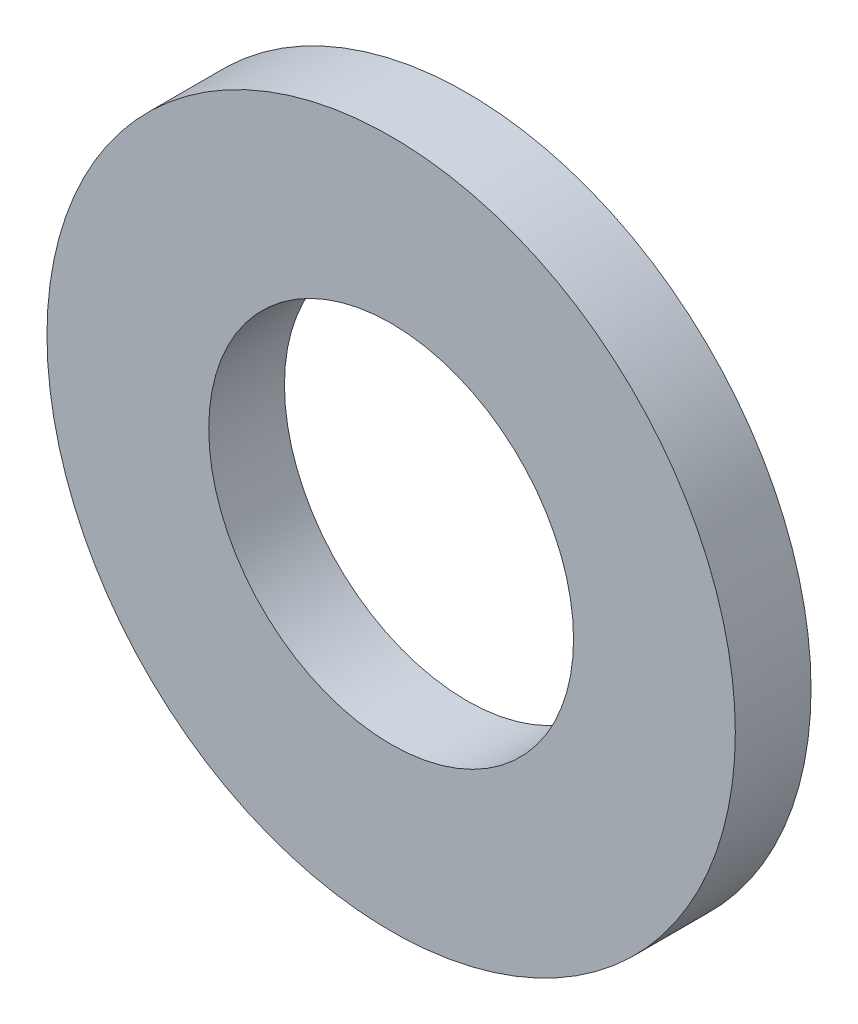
from build123d import *

# Parameters (mm, degrees)
SKETCH1_R           = 5
SKETCH1_R_2         = 2.65
BOSS_EXTRUDE1_DEPTH = 1.1


with BuildPart() as part:
    # Sketch1 → Boss-Extrude1 (new body)
    with BuildSketch(Plane.XY):
        Circle(SKETCH1_R)
        Circle(SKETCH1_R_2, mode=Mode.SUBTRACT)
    extrude(amount=BOSS_EXTRUDE1_DEPTH)


solid = part.part
